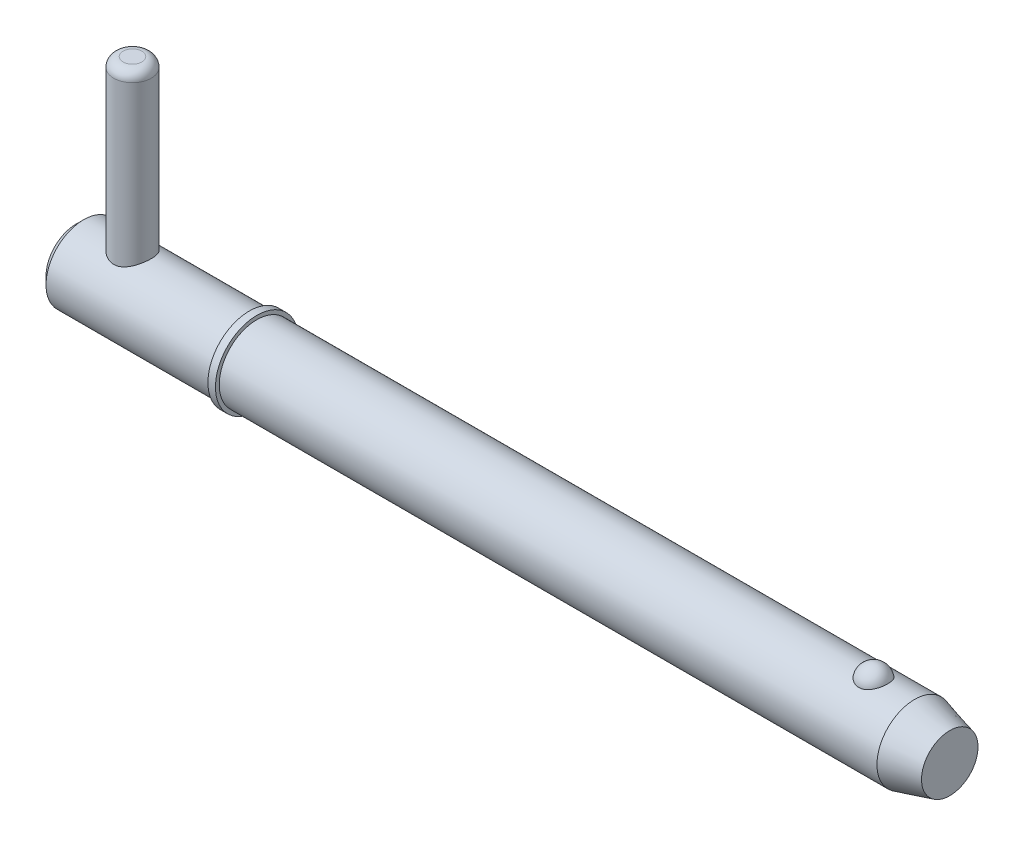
ISO-10303-21;
HEADER;
FILE_DESCRIPTION(('STEP AP214'),'2;1');
FILE_NAME('part.step','',(''),(''),'','','');
FILE_SCHEMA(('AUTOMOTIVE_DESIGN { 1 0 10303 214 1 1 1 1 }'));
ENDSEC;
DATA;
#1=APPLICATION_CONTEXT('core data for automotive mechanical design processes');
#2=APPLICATION_PROTOCOL_DEFINITION('international standard','automotive_design',2000,#1);
#3=PRODUCT_CONTEXT('',#1,'mechanical');
#4=PRODUCT('Part','Part','',(#3));
#5=PRODUCT_RELATED_PRODUCT_CATEGORY('part','',(#4));
#6=PRODUCT_DEFINITION_FORMATION('','',#4);
#7=PRODUCT_DEFINITION_CONTEXT('part definition',#1,'design');
#8=PRODUCT_DEFINITION('design','',#6,#7);
#9=PRODUCT_DEFINITION_SHAPE('','',#8);
#10=(LENGTH_UNIT() NAMED_UNIT(*) SI_UNIT(.MILLI.,.METRE.));
#11=(NAMED_UNIT(*) PLANE_ANGLE_UNIT() SI_UNIT($,.RADIAN.));
#12=(NAMED_UNIT(*) SI_UNIT($,.STERADIAN.) SOLID_ANGLE_UNIT());
#13=UNCERTAINTY_MEASURE_WITH_UNIT(LENGTH_MEASURE(1.E-05),#10,'distance_accuracy_value','');
#14=(GEOMETRIC_REPRESENTATION_CONTEXT(3) GLOBAL_UNCERTAINTY_ASSIGNED_CONTEXT((#13)) GLOBAL_UNIT_ASSIGNED_CONTEXT((#10,
#11,#12)) REPRESENTATION_CONTEXT('',''));
#15=CARTESIAN_POINT('',(0.,0.,0.));
#16=DIRECTION('',(0.,0.,1.));
#17=DIRECTION('',(1.,0.,0.));
#18=AXIS2_PLACEMENT_3D('',#15,#16,#17);
#19=CARTESIAN_POINT('',(5.94,21.43,0.));
#20=DIRECTION('',(0.,-1.,0.));
#21=DIRECTION('',(0.,0.,-1.));
#22=AXIS2_PLACEMENT_3D('',#19,#20,#21);
#23=CYLINDRICAL_SURFACE('',#22,1.98);
#24=CARTESIAN_POINT('',(5.94,-2.98,0.));
#25=DIRECTION('',(0.,1.,0.));
#26=DIRECTION('',(0.,0.,1.));
#27=AXIS2_PLACEMENT_3D('',#24,#25,#26);
#28=CIRCLE('',#27,1.98);
#29=CARTESIAN_POINT('',(5.94,-2.98,1.98));
#30=VERTEX_POINT('',#29);
#31=EDGE_CURVE('P0_E25',#30,#30,#28,.T.);
#32=ORIENTED_EDGE('',*,*,#31,.T.);
#33=EDGE_LOOP('',(#32));
#34=FACE_BOUND('',#33,.T.);
#35=CARTESIAN_POINT('',(5.94,20.44,0.));
#36=DIRECTION('',(0.,1.,0.));
#37=DIRECTION('',(0.,0.,1.));
#38=AXIS2_PLACEMENT_3D('',#35,#36,#37);
#39=CIRCLE('',#38,1.98);
#40=CARTESIAN_POINT('',(5.94,20.44,1.98));
#41=VERTEX_POINT('',#40);
#42=EDGE_CURVE('P0_E29',#41,#41,#39,.F.);
#43=ORIENTED_EDGE('',*,*,#42,.T.);
#44=EDGE_LOOP('',(#43));
#45=FACE_BOUND('',#44,.T.);
#46=ADVANCED_FACE('P0_F14',(#34,#45),#23,.T.);
#47=CARTESIAN_POINT('',(5.94,21.43,0.));
#48=DIRECTION('',(0.,1.,0.));
#49=DIRECTION('',(0.,0.,1.));
#50=AXIS2_PLACEMENT_3D('',#47,#48,#49);
#51=PLANE('',#50);
#52=CARTESIAN_POINT('',(5.94,21.43,0.));
#53=DIRECTION('',(0.,1.,0.));
#54=DIRECTION('',(0.,0.,1.));
#55=AXIS2_PLACEMENT_3D('',#52,#53,#54);
#56=CIRCLE('',#55,0.99);
#57=CARTESIAN_POINT('',(5.94,21.43,0.99));
#58=VERTEX_POINT('',#57);
#59=EDGE_CURVE('P0_E10',#58,#58,#56,.T.);
#60=ORIENTED_EDGE('',*,*,#59,.T.);
#61=EDGE_LOOP('',(#60));
#62=FACE_BOUND('',#61,.T.);
#63=ADVANCED_FACE('P0_F46',(#62),#51,.T.);
#64=CARTESIAN_POINT('',(5.94,-3.97,0.));
#65=DIRECTION('',(0.,1.,0.));
#66=DIRECTION('',(0.,0.,1.));
#67=AXIS2_PLACEMENT_3D('',#64,#65,#66);
#68=PLANE('',#67);
#69=CARTESIAN_POINT('',(5.94,-3.97,0.));
#70=DIRECTION('',(0.,1.,0.));
#71=DIRECTION('',(0.,0.,1.));
#72=AXIS2_PLACEMENT_3D('',#69,#70,#71);
#73=CIRCLE('',#72,0.99);
#74=CARTESIAN_POINT('',(5.94,-3.97,0.99));
#75=VERTEX_POINT('',#74);
#76=EDGE_CURVE('P0_E21',#75,#75,#73,.F.);
#77=ORIENTED_EDGE('',*,*,#76,.T.);
#78=EDGE_LOOP('',(#77));
#79=FACE_BOUND('',#78,.T.);
#80=ADVANCED_FACE('P0_F43',(#79),#68,.F.);
#81=CARTESIAN_POINT('',(5.94,-2.98,0.));
#82=DIRECTION('',(0.,1.,0.));
#83=DIRECTION('',(0.,0.,1.));
#84=AXIS2_PLACEMENT_3D('',#81,#82,#83);
#85=DEGENERATE_TOROIDAL_SURFACE('',#84,0.99,0.99,.T.);
#86=ORIENTED_EDGE('',*,*,#76,.F.);
#87=EDGE_LOOP('',(#86));
#88=FACE_BOUND('',#87,.T.);
#89=ORIENTED_EDGE('',*,*,#31,.F.);
#90=EDGE_LOOP('',(#89));
#91=FACE_BOUND('',#90,.T.);
#92=ADVANCED_FACE('P0_F38',(#88,#91),#85,.T.);
#93=CARTESIAN_POINT('',(5.94,20.44,0.));
#94=DIRECTION('',(0.,1.,0.));
#95=DIRECTION('',(0.,0.,1.));
#96=AXIS2_PLACEMENT_3D('',#93,#94,#95);
#97=DEGENERATE_TOROIDAL_SURFACE('',#96,0.99,0.99,.T.);
#98=ORIENTED_EDGE('',*,*,#42,.F.);
#99=EDGE_LOOP('',(#98));
#100=FACE_BOUND('',#99,.T.);
#101=ORIENTED_EDGE('',*,*,#59,.F.);
#102=EDGE_LOOP('',(#101));
#103=FACE_BOUND('',#102,.T.);
#104=ADVANCED_FACE('P0_F16',(#100,#103),#97,.T.);
#105=CLOSED_SHELL('',(#46,#63,#80,#92,#104));
#106=MANIFOLD_SOLID_BREP('P0_B1',#105);
#107=CARTESIAN_POINT('',(0.,0.,0.));
#108=DIRECTION('',(1.,0.,0.));
#109=DIRECTION('',(0.,0.,-1.));
#110=AXIS2_PLACEMENT_3D('',#107,#108,#109);
#111=CYLINDRICAL_SURFACE('',#110,3.97);
#112=CARTESIAN_POINT('',(88.3759395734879,0.,0.));
#113=DIRECTION('',(1.,0.,0.));
#114=DIRECTION('',(0.,0.,-1.));
#115=AXIS2_PLACEMENT_3D('',#112,#113,#114);
#116=CIRCLE('',#115,3.97);
#117=CARTESIAN_POINT('',(88.3759395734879,0.,-3.97));
#118=VERTEX_POINT('',#117);
#119=EDGE_CURVE('P1_E81',#118,#118,#116,.T.);
#120=ORIENTED_EDGE('',*,*,#119,.F.);
#121=EDGE_LOOP('',(#120));
#122=FACE_BOUND('',#121,.T.);
#123=CARTESIAN_POINT('',(19.05,0.,0.));
#124=DIRECTION('',(1.,0.,0.));
#125=DIRECTION('',(0.,0.,-1.));
#126=AXIS2_PLACEMENT_3D('',#123,#124,#125);
#127=CIRCLE('',#126,3.97);
#128=CARTESIAN_POINT('',(19.05,0.,-3.97));
#129=VERTEX_POINT('',#128);
#130=EDGE_CURVE('P1_E85',#129,#129,#127,.T.);
#131=ORIENTED_EDGE('',*,*,#130,.T.);
#132=EDGE_LOOP('',(#131));
#133=FACE_BOUND('',#132,.T.);
#134=CARTESIAN_POINT('',(84.0451922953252,3.65715365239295,1.54470941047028));
#135=CARTESIAN_POINT('',(83.9652448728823,3.65716001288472,1.54470290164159));
#136=CARTESIAN_POINT('',(83.8851650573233,3.65987074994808,1.53832549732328));
#137=CARTESIAN_POINT('',(83.7272374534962,3.6704221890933,1.51297018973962));
#138=CARTESIAN_POINT('',(83.6493961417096,3.67827646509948,1.49395894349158));
#139=CARTESIAN_POINT('',(83.4984614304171,3.69818848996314,1.44395950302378));
#140=CARTESIAN_POINT('',(83.4253560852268,3.71023513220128,1.41300293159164));
#141=CARTESIAN_POINT('',(83.2855630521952,3.73721833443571,1.34000212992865));
#142=CARTESIAN_POINT('',(83.2188725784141,3.75215363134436,1.2979627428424));
#143=CARTESIAN_POINT('',(83.0914886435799,3.78384968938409,1.20248834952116));
#144=CARTESIAN_POINT('',(83.0310299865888,3.80065129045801,1.14875388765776));
#145=CARTESIAN_POINT('',(82.9196942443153,3.83398532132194,1.03205417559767));
#146=CARTESIAN_POINT('',(82.8688200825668,3.85051766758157,0.969086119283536));
#147=CARTESIAN_POINT('',(82.7756321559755,3.88238608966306,0.832526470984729));
#148=CARTESIAN_POINT('',(82.7337961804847,3.89763698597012,0.758588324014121));
#149=CARTESIAN_POINT('',(82.6625108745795,3.92451063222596,0.60435211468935));
#150=CARTESIAN_POINT('',(82.6330623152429,3.93613315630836,0.524053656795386));
#151=CARTESIAN_POINT('',(82.5868927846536,3.95467606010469,0.358403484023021));
#152=CARTESIAN_POINT('',(82.5703127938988,3.96154426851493,0.273006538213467));
#153=CARTESIAN_POINT('',(82.550756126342,3.96967008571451,0.100408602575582));
#154=CARTESIAN_POINT('',(82.5477789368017,3.97092790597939,0.0132076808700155));
#155=CARTESIAN_POINT('',(82.5554587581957,3.96771794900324,-0.159844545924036));
#156=CARTESIAN_POINT('',(82.5660164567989,3.96329187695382,-0.245701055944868));
#157=CARTESIAN_POINT('',(82.6003800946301,3.94923163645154,-0.41427746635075));
#158=CARTESIAN_POINT('',(82.6241862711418,3.93959737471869,-0.496997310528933));
#159=CARTESIAN_POINT('',(82.6846114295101,3.91607752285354,-0.657113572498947));
#160=CARTESIAN_POINT('',(82.7212495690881,3.90218558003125,-0.734501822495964));
#161=CARTESIAN_POINT('',(82.8065935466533,3.87158287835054,-0.881704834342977));
#162=CARTESIAN_POINT('',(82.8553004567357,3.8548718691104,-0.951518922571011));
#163=CARTESIAN_POINT('',(82.9641161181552,3.82028735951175,-1.08208159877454));
#164=CARTESIAN_POINT('',(83.0242955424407,3.80240713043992,-1.14276958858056));
#165=CARTESIAN_POINT('',(83.154493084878,3.76758161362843,-1.2528243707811));
#166=CARTESIAN_POINT('',(83.2245105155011,3.75063626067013,-1.30219195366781));
#167=CARTESIAN_POINT('',(83.37118160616,3.71998948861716,-1.38729709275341));
#168=CARTESIAN_POINT('',(83.4476813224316,3.70623183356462,-1.42327904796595));
#169=CARTESIAN_POINT('',(83.6062981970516,3.68323188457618,-1.48178996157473));
#170=CARTESIAN_POINT('',(83.6884132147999,3.67398788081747,-1.5043240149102));
#171=CARTESIAN_POINT('',(83.8514810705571,3.6615216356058,-1.53440939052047));
#172=CARTESIAN_POINT('',(83.9322840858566,3.65801951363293,-1.54265826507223));
#173=CARTESIAN_POINT('',(84.0942085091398,3.65657341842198,-1.54608423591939));
#174=CARTESIAN_POINT('',(84.1753298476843,3.65862829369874,-1.54126404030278));
#175=CARTESIAN_POINT('',(84.3328122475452,3.66788969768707,-1.51908474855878));
#176=CARTESIAN_POINT('',(84.4092422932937,3.67492621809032,-1.50213925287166));
#177=CARTESIAN_POINT('',(84.5580412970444,3.69318404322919,-1.45666982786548));
#178=CARTESIAN_POINT('',(84.6304099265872,3.70440568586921,-1.42814496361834));
#179=CARTESIAN_POINT('',(84.7708029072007,3.73012749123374,-1.35956319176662));
#180=CARTESIAN_POINT('',(84.8387000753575,3.74469307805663,-1.31927107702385));
#181=CARTESIAN_POINT('',(84.9668649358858,3.77545272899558,-1.22847440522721));
#182=CARTESIAN_POINT('',(85.0271308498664,3.79164717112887,-1.17796747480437));
#183=CARTESIAN_POINT('',(85.1416346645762,3.82490325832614,-1.06519260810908));
#184=CARTESIAN_POINT('',(85.1954137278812,3.84196735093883,-1.00245914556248));
#185=CARTESIAN_POINT('',(85.2920988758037,3.87439863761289,-0.868715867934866));
#186=CARTESIAN_POINT('',(85.3350030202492,3.88976552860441,-0.797704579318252));
#187=CARTESIAN_POINT('',(85.410266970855,3.91771381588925,-0.646896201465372));
#188=CARTESIAN_POINT('',(85.4422532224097,3.93019255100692,-0.566893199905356));
#189=CARTESIAN_POINT('',(85.4931101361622,3.95043886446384,-0.402255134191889));
#190=CARTESIAN_POINT('',(85.5119807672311,3.95820643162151,-0.317620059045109));
#191=CARTESIAN_POINT('',(85.5362162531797,3.96823733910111,-0.146156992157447));
#192=CARTESIAN_POINT('',(85.5415874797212,3.970503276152,-0.0593300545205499));
#193=CARTESIAN_POINT('',(85.5387309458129,3.96930811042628,0.114057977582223));
#194=CARTESIAN_POINT('',(85.530503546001,3.9658471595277,0.200619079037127));
#195=CARTESIAN_POINT('',(85.5007063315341,3.95358562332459,0.370506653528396));
#196=CARTESIAN_POINT('',(85.4792129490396,3.94481563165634,0.453848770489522));
#197=CARTESIAN_POINT('',(85.4233839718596,3.92284586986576,0.615497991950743));
#198=CARTESIAN_POINT('',(85.3890474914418,3.90964579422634,0.693804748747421));
#199=CARTESIAN_POINT('',(85.3079702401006,3.88006987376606,0.843703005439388));
#200=CARTESIAN_POINT('',(85.2611536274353,3.86367478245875,0.915249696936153));
#201=CARTESIAN_POINT('',(85.1561897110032,3.82949741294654,1.04910810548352));
#202=CARTESIAN_POINT('',(85.0980428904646,3.81171519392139,1.11142021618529));
#203=CARTESIAN_POINT('',(84.9717433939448,3.77673366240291,1.22503948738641));
#204=CARTESIAN_POINT('',(84.9035970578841,3.75953398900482,1.27635357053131));
#205=CARTESIAN_POINT('',(84.7589009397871,3.72770506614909,1.36653336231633));
#206=CARTESIAN_POINT('',(84.682348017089,3.71307678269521,1.40539439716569));
#207=CARTESIAN_POINT('',(84.5257594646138,3.68864287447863,1.46830480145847));
#208=CARTESIAN_POINT('',(84.4459307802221,3.67869017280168,1.49281289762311));
#209=CARTESIAN_POINT('',(84.2829877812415,3.66414535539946,1.52817474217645));
#210=CARTESIAN_POINT('',(84.1998840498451,3.65953723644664,1.53906926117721));
#211=CARTESIAN_POINT('',(84.0927760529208,3.6573894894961,1.54414878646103));
#212=CARTESIAN_POINT('',(84.0689900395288,3.65715175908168,1.54471134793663));
#213=CARTESIAN_POINT('',(84.0451922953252,3.65715365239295,1.54470941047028));
#214=B_SPLINE_CURVE_WITH_KNOTS('',3,(#134,#135,#136,#137,#138,#139,#140,#141,#142,#143,#144,
#145,#146,#147,#148,#149,#150,#151,#152,#153,#154,#155,#156,#157,#158,#159,#160,#161,#162,#163,
#164,#165,#166,#167,#168,#169,#170,#171,#172,#173,#174,#175,#176,#177,#178,#179,#180,#181,#182,
#183,#184,#185,#186,#187,#188,#189,#190,#191,#192,#193,#194,#195,#196,#197,#198,#199,#200,#201,
#202,#203,#204,#205,#206,#207,#208,#209,#210,#211,#212,#213),.UNSPECIFIED.,.T.,.F.,(4,2,2,2,2,2,
2,2,2,2,2,2,2,2,2,2,2,2,2,2,2,2,2,2,2,2,2,2,2,2,2,2,2,2,2,2,2,2,2,4),(0.,0.239777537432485,
0.480190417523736,0.719971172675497,0.959647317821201,1.20639040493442,1.45320863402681,
1.7109367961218,1.96868099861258,2.22921052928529,2.48973023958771,2.74834928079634,
3.00697295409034,3.26598440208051,3.52501886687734,3.78570385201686,4.04637062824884,
4.30201257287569,4.5575576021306,4.80022994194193,5.04285200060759,5.27757006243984,
5.51230707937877,5.75210128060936,5.99195126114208,6.24392810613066,6.49594987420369,
6.75588818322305,7.01582710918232,7.27564332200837,7.53545264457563,7.79377886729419,
8.0521229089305,8.31207418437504,8.57201437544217,8.83179046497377,9.09166393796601,
9.34270057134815,9.59298357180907,9.66435753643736),.UNSPECIFIED.);
#215=CARTESIAN_POINT('',(84.0451922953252,3.65715365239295,1.54470941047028));
#216=VERTEX_POINT('',#215);
#217=EDGE_CURVE('P1_E35',#216,#216,#214,.T.);
#218=ORIENTED_EDGE('',*,*,#217,.T.);
#219=EDGE_LOOP('',(#218));
#220=FACE_BOUND('',#219,.T.);
#221=ADVANCED_FACE('P1_F13',(#122,#133,#220),#111,.T.);
#222=CARTESIAN_POINT('',(0.,0.,0.));
#223=DIRECTION('',(-1.,0.,0.));
#224=DIRECTION('',(0.,0.,1.));
#225=AXIS2_PLACEMENT_3D('',#222,#223,#224);
#226=PLANE('',#225);
#227=CARTESIAN_POINT('',(0.,0.,0.));
#228=DIRECTION('',(1.,0.,0.));
#229=DIRECTION('',(0.,0.,-1.));
#230=AXIS2_PLACEMENT_3D('',#227,#228,#229);
#231=CIRCLE('',#230,3.176);
#232=CARTESIAN_POINT('',(0.,0.,-3.176));
#233=VERTEX_POINT('',#232);
#234=EDGE_CURVE('P1_E9',#233,#233,#231,.T.);
#235=ORIENTED_EDGE('',*,*,#234,.F.);
#236=EDGE_LOOP('',(#235));
#237=FACE_BOUND('',#236,.T.);
#238=ADVANCED_FACE('P1_F15',(#237),#226,.T.);
#239=CARTESIAN_POINT('',(0.793999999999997,0.,0.));
#240=DIRECTION('',(1.,0.,0.));
#241=DIRECTION('',(0.,0.,-1.));
#242=AXIS2_PLACEMENT_3D('',#239,#240,#241);
#243=CONICAL_SURFACE('',#242,3.97,0.78539816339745);
#244=ORIENTED_EDGE('',*,*,#234,.T.);
#245=EDGE_LOOP('',(#244));
#246=FACE_BOUND('',#245,.T.);
#247=CARTESIAN_POINT('',(0.793999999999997,0.,0.));
#248=DIRECTION('',(1.,0.,0.));
#249=DIRECTION('',(0.,0.,-1.));
#250=AXIS2_PLACEMENT_3D('',#247,#248,#249);
#251=CIRCLE('',#250,3.97);
#252=CARTESIAN_POINT('',(0.793999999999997,0.,-3.97));
#253=VERTEX_POINT('',#252);
#254=EDGE_CURVE('P1_E26',#253,#253,#251,.T.);
#255=ORIENTED_EDGE('',*,*,#254,.F.);
#256=EDGE_LOOP('',(#255));
#257=FACE_BOUND('',#256,.T.);
#258=ADVANCED_FACE('P1_F77',(#246,#257),#243,.T.);
#259=CARTESIAN_POINT('',(0.,0.,0.));
#260=DIRECTION('',(1.,0.,0.));
#261=DIRECTION('',(0.,0.,-1.));
#262=AXIS2_PLACEMENT_3D('',#259,#260,#261);
#263=CYLINDRICAL_SURFACE('',#262,3.97);
#264=CARTESIAN_POINT('',(5.94,-3.44100276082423,1.98));
#265=CARTESIAN_POINT('',(5.8367885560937,-3.44101282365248,1.97999171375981));
#266=CARTESIAN_POINT('',(5.73344176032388,-3.44571749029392,1.97187534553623));
#267=CARTESIAN_POINT('',(5.52991905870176,-3.46385873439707,1.93981946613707));
#268=CARTESIAN_POINT('',(5.42975031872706,-3.47731375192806,1.91584653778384));
#269=CARTESIAN_POINT('',(5.23590869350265,-3.51100678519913,1.85336773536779));
#270=CARTESIAN_POINT('',(5.14220446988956,-3.53120882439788,1.81493880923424));
#271=CARTESIAN_POINT('',(4.9625969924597,-3.57606420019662,1.72487335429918));
#272=CARTESIAN_POINT('',(4.87669412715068,-3.6007177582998,1.67323616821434));
#273=CARTESIAN_POINT('',(4.70734412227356,-3.65417020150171,1.55325205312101));
#274=CARTESIAN_POINT('',(4.62467662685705,-3.68314323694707,1.4838818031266));
#275=CARTESIAN_POINT('',(4.47154355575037,-3.74056406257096,1.33252902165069));
#276=CARTESIAN_POINT('',(4.40108404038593,-3.76901158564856,1.25054026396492));
#277=CARTESIAN_POINT('',(4.26974803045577,-3.82445556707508,1.06956584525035));
#278=CARTESIAN_POINT('',(4.20982960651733,-3.8512271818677,0.969809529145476));
#279=CARTESIAN_POINT('',(4.10798077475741,-3.89804342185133,0.760047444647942));
#280=CARTESIAN_POINT('',(4.06603907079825,-3.91809226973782,0.650048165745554));
#281=CARTESIAN_POINT('',(4.00441878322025,-3.94794912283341,0.431181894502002));
#282=CARTESIAN_POINT('',(3.98337329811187,-3.95838209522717,0.322786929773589));
#283=CARTESIAN_POINT('',(3.9596425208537,-3.97016407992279,0.103541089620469));
#284=CARTESIAN_POINT('',(3.95694618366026,-3.97151855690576,-0.00730826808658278));
#285=CARTESIAN_POINT('',(3.9694599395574,-3.96528826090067,-0.218044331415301));
#286=CARTESIAN_POINT('',(3.98314071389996,-3.95846689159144,-0.318049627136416));
#287=CARTESIAN_POINT('',(4.02528522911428,-3.93780347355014,-0.514124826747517));
#288=CARTESIAN_POINT('',(4.05375007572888,-3.92396089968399,-0.61019443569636));
#289=CARTESIAN_POINT('',(4.12484256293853,-3.89028355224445,-0.797351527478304));
#290=CARTESIAN_POINT('',(4.16766142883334,-3.87036821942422,-0.888351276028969));
#291=CARTESIAN_POINT('',(4.26598377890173,-3.82634285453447,-1.06209448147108));
#292=CARTESIAN_POINT('',(4.32149181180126,-3.8022313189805,-1.14483496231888));
#293=CARTESIAN_POINT('',(4.44962332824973,-3.74940011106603,-1.30802500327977));
#294=CARTESIAN_POINT('',(4.52336636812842,-3.72046031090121,-1.38752498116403));
#295=CARTESIAN_POINT('',(4.68287656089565,-3.66269463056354,-1.53354043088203));
#296=CARTESIAN_POINT('',(4.7686527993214,-3.63386885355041,-1.60004599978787));
#297=CARTESIAN_POINT('',(4.9564069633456,-3.57763161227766,-1.72228426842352));
#298=CARTESIAN_POINT('',(5.05906485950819,-3.5504233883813,-1.77707534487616));
#299=CARTESIAN_POINT('',(5.27381412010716,-3.50334038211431,-1.86819784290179));
#300=CARTESIAN_POINT('',(5.38589553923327,-3.48345798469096,-1.90454844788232));
#301=CARTESIAN_POINT('',(5.6069795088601,-3.45548331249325,-1.95481643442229));
#302=CARTESIAN_POINT('',(5.71552407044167,-3.44658268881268,-1.97028113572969));
#303=CARTESIAN_POINT('',(5.93399639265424,-3.43928114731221,-1.98300600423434));
#304=CARTESIAN_POINT('',(6.04392313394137,-3.44087289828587,-1.98027888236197));
#305=CARTESIAN_POINT('',(6.24931618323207,-3.45351901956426,-1.95811780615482));
#306=CARTESIAN_POINT('',(6.34505668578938,-3.46352725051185,-1.94052989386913));
#307=CARTESIAN_POINT('',(6.53204702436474,-3.49033612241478,-1.89188242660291));
#308=CARTESIAN_POINT('',(6.62329540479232,-3.50713894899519,-1.86081853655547));
#309=CARTESIAN_POINT('',(6.80352105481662,-3.54655680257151,-1.78458666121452));
#310=CARTESIAN_POINT('',(6.89219712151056,-3.56940508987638,-1.73883178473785));
#311=CARTESIAN_POINT('',(7.06112449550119,-3.61813012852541,-1.63502913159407));
#312=CARTESIAN_POINT('',(7.14137144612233,-3.6440084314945,-1.57697504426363));
#313=CARTESIAN_POINT('',(7.30168083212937,-3.69977514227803,-1.44171920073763));
#314=CARTESIAN_POINT('',(7.38046039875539,-3.7297597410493,-1.36302972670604));
#315=CARTESIAN_POINT('',(7.52409649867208,-3.78754991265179,-1.19307190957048));
#316=CARTESIAN_POINT('',(7.58894840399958,-3.81535475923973,-1.10179940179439));
#317=CARTESIAN_POINT('',(7.70430122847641,-3.86658972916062,-0.906019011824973));
#318=CARTESIAN_POINT('',(7.75438714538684,-3.88988795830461,-0.801229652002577));
#319=CARTESIAN_POINT('',(7.83572184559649,-3.92848199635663,-0.583216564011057));
#320=CARTESIAN_POINT('',(7.86698708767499,-3.94378479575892,-0.470000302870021));
#321=CARTESIAN_POINT('',(7.90711051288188,-3.96355307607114,-0.249525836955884));
#322=CARTESIAN_POINT('',(7.91775648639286,-3.96888171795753,-0.142669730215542));
#323=CARTESIAN_POINT('',(7.92160247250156,-3.97079858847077,0.0714191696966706));
#324=CARTESIAN_POINT('',(7.91480852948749,-3.96738984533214,0.178651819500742));
#325=CARTESIAN_POINT('',(7.88515479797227,-3.9527181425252,0.383072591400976));
#326=CARTESIAN_POINT('',(7.8633739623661,-3.94198303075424,0.480459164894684));
#327=CARTESIAN_POINT('',(7.80581513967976,-3.91422178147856,0.670038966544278));
#328=CARTESIAN_POINT('',(7.77003513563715,-3.89719473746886,0.762231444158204));
#329=CARTESIAN_POINT('',(7.68389191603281,-3.85747818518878,0.943248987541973));
#330=CARTESIAN_POINT('',(7.63296879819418,-3.83457704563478,1.03175978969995));
#331=CARTESIAN_POINT('',(7.51869140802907,-3.7855122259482,1.19934744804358));
#332=CARTESIAN_POINT('',(7.45533142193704,-3.75934704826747,1.2784199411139));
#333=CARTESIAN_POINT('',(7.31068939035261,-3.70329841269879,1.433144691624));
#334=CARTESIAN_POINT('',(7.22825362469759,-3.67330340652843,1.50768183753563));
#335=CARTESIAN_POINT('',(7.05162367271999,-3.61514025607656,1.64226879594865));
#336=CARTESIAN_POINT('',(6.95741928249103,-3.58697372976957,1.70230590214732));
#337=CARTESIAN_POINT('',(6.75590859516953,-3.53504049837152,1.80775364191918));
#338=CARTESIAN_POINT('',(6.64828786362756,-3.51143624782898,1.85265616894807));
#339=CARTESIAN_POINT('',(6.48137774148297,-3.48289659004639,1.90544537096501));
#340=CARTESIAN_POINT('',(6.42488151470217,-3.4745323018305,1.9206071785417));
#341=CARTESIAN_POINT('',(6.31046920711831,-3.4604244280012,1.94591259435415));
#342=CARTESIAN_POINT('',(6.25255415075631,-3.45467900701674,1.95605971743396));
#343=CARTESIAN_POINT('',(6.1521444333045,-3.44728060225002,1.96905939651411));
#344=CARTESIAN_POINT('',(6.10985721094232,-3.44493297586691,1.97315742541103));
#345=CARTESIAN_POINT('',(6.02505433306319,-3.44179192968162,1.97862952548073));
#346=CARTESIAN_POINT('',(5.98253866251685,-3.44099861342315,1.98000341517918));
#347=CARTESIAN_POINT('',(5.94,-3.44100276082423,1.98));
#348=B_SPLINE_CURVE_WITH_KNOTS('',3,(#264,#265,#266,#267,#268,#269,#270,#271,#272,#273,#274,
#275,#276,#277,#278,#279,#280,#281,#282,#283,#284,#285,#286,#287,#288,#289,#290,#291,#292,#293,
#294,#295,#296,#297,#298,#299,#300,#301,#302,#303,#304,#305,#306,#307,#308,#309,#310,#311,#312,
#313,#314,#315,#316,#317,#318,#319,#320,#321,#322,#323,#324,#325,#326,#327,#328,#329,#330,#331,
#332,#333,#334,#335,#336,#337,#338,#339,#340,#341,#342,#343,#344,#345,#346,#347),.UNSPECIFIED.,
.T.,.F.,(4,2,2,2,2,2,2,2,2,2,2,2,2,2,2,2,2,2,2,2,2,2,2,2,2,2,2,2,2,2,2,2,2,2,2,2,2,2,2,2,2,4),
(0.,0.309462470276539,0.619579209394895,0.928068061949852,1.23657226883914,1.57038619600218,
1.90436536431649,2.26071614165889,2.61684266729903,2.94773555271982,3.27842924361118,
3.58050679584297,3.88260694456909,4.18890317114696,4.49530936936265,4.83057163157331,
5.1660884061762,5.52272472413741,5.87898927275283,6.20706708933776,6.53491569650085,
6.82716910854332,7.11951660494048,7.42541184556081,7.73146442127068,8.07586334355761,
8.42037652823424,8.77380887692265,9.12693169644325,9.44775848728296,9.76847409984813,
10.0682302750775,10.3680296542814,10.6806938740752,10.9935020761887,11.3373031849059,
11.6814044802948,12.0361164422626,12.2131519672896,12.3900632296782,12.5175998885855,
12.6451450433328),.UNSPECIFIED.);
#349=CARTESIAN_POINT('',(5.94,-3.44100276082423,1.98));
#350=VERTEX_POINT('',#349);
#351=EDGE_CURVE('P1_E17',#350,#350,#348,.T.);
#352=ORIENTED_EDGE('',*,*,#351,.F.);
#353=EDGE_LOOP('',(#352));
#354=FACE_BOUND('',#353,.T.);
#355=CARTESIAN_POINT('',(5.94,3.44100276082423,1.98));
#356=CARTESIAN_POINT('',(6.0432114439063,3.44101282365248,1.97999171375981));
#357=CARTESIAN_POINT('',(6.14655823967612,3.44571749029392,1.97187534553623));
#358=CARTESIAN_POINT('',(6.35008094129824,3.46385873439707,1.93981946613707));
#359=CARTESIAN_POINT('',(6.45024968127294,3.47731375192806,1.91584653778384));
#360=CARTESIAN_POINT('',(6.64409130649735,3.51100678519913,1.85336773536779));
#361=CARTESIAN_POINT('',(6.73779553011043,3.53120882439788,1.81493880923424));
#362=CARTESIAN_POINT('',(6.91740300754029,3.57606420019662,1.72487335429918));
#363=CARTESIAN_POINT('',(7.00330587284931,3.6007177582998,1.67323616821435));
#364=CARTESIAN_POINT('',(7.17265587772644,3.65417020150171,1.55325205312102));
#365=CARTESIAN_POINT('',(7.25532337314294,3.68314323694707,1.4838818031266));
#366=CARTESIAN_POINT('',(7.40845644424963,3.74056406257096,1.3325290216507));
#367=CARTESIAN_POINT('',(7.47891595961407,3.76901158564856,1.25054026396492));
#368=CARTESIAN_POINT('',(7.61025196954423,3.82445556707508,1.06956584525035));
#369=CARTESIAN_POINT('',(7.67017039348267,3.8512271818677,0.969809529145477));
#370=CARTESIAN_POINT('',(7.77201922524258,3.89804342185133,0.760047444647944));
#371=CARTESIAN_POINT('',(7.81396092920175,3.91809226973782,0.650048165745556));
#372=CARTESIAN_POINT('',(7.87558121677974,3.94794912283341,0.431181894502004));
#373=CARTESIAN_POINT('',(7.89662670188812,3.95838209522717,0.322786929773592));
#374=CARTESIAN_POINT('',(7.9203574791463,3.97016407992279,0.103541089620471));
#375=CARTESIAN_POINT('',(7.92305381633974,3.97151855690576,-0.00730826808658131));
#376=CARTESIAN_POINT('',(7.9105400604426,3.96528826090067,-0.2180443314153));
#377=CARTESIAN_POINT('',(7.89685928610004,3.95846689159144,-0.318049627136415));
#378=CARTESIAN_POINT('',(7.85471477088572,3.93780347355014,-0.514124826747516));
#379=CARTESIAN_POINT('',(7.82624992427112,3.92396089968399,-0.61019443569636));
#380=CARTESIAN_POINT('',(7.75515743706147,3.89028355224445,-0.797351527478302));
#381=CARTESIAN_POINT('',(7.71233857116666,3.87036821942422,-0.888351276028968));
#382=CARTESIAN_POINT('',(7.61401622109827,3.82634285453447,-1.06209448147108));
#383=CARTESIAN_POINT('',(7.55850818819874,3.8022313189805,-1.14483496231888));
#384=CARTESIAN_POINT('',(7.43037667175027,3.74940011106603,-1.30802500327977));
#385=CARTESIAN_POINT('',(7.35663363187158,3.72046031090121,-1.38752498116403));
#386=CARTESIAN_POINT('',(7.19712343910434,3.66269463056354,-1.53354043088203));
#387=CARTESIAN_POINT('',(7.1113472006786,3.63386885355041,-1.60004599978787));
#388=CARTESIAN_POINT('',(6.9235930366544,3.57763161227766,-1.72228426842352));
#389=CARTESIAN_POINT('',(6.82093514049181,3.5504233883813,-1.77707534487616));
#390=CARTESIAN_POINT('',(6.60618587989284,3.50334038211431,-1.86819784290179));
#391=CARTESIAN_POINT('',(6.49410446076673,3.48345798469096,-1.90454844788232));
#392=CARTESIAN_POINT('',(6.2730204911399,3.45548331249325,-1.95481643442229));
#393=CARTESIAN_POINT('',(6.16447592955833,3.44658268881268,-1.97028113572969));
#394=CARTESIAN_POINT('',(5.94600360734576,3.43928114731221,-1.98300600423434));
#395=CARTESIAN_POINT('',(5.83607686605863,3.44087289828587,-1.98027888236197));
#396=CARTESIAN_POINT('',(5.63068381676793,3.45351901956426,-1.95811780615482));
#397=CARTESIAN_POINT('',(5.53494331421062,3.46352725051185,-1.94052989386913));
#398=CARTESIAN_POINT('',(5.34795297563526,3.49033612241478,-1.89188242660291));
#399=CARTESIAN_POINT('',(5.25670459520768,3.50713894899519,-1.86081853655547));
#400=CARTESIAN_POINT('',(5.07647894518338,3.54655680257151,-1.78458666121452));
#401=CARTESIAN_POINT('',(4.98780287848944,3.56940508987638,-1.73883178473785));
#402=CARTESIAN_POINT('',(4.81887550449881,3.61813012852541,-1.63502913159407));
#403=CARTESIAN_POINT('',(4.73862855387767,3.6440084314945,-1.57697504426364));
#404=CARTESIAN_POINT('',(4.57831916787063,3.69977514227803,-1.44171920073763));
#405=CARTESIAN_POINT('',(4.49953960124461,3.7297597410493,-1.36302972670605));
#406=CARTESIAN_POINT('',(4.35590350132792,3.78754991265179,-1.19307190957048));
#407=CARTESIAN_POINT('',(4.29105159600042,3.81535475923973,-1.10179940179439));
#408=CARTESIAN_POINT('',(4.17569877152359,3.86658972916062,-0.906019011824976));
#409=CARTESIAN_POINT('',(4.12561285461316,3.88988795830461,-0.80122965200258));
#410=CARTESIAN_POINT('',(4.04427815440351,3.92848199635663,-0.58321656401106));
#411=CARTESIAN_POINT('',(4.01301291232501,3.94378479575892,-0.470000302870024));
#412=CARTESIAN_POINT('',(3.97288948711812,3.96355307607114,-0.249525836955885));
#413=CARTESIAN_POINT('',(3.96224351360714,3.96888171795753,-0.142669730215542));
#414=CARTESIAN_POINT('',(3.95839752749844,3.97079858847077,0.0714191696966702));
#415=CARTESIAN_POINT('',(3.96519147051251,3.96738984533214,0.178651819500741));
#416=CARTESIAN_POINT('',(3.99484520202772,3.9527181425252,0.383072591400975));
#417=CARTESIAN_POINT('',(4.01662603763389,3.94198303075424,0.480459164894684));
#418=CARTESIAN_POINT('',(4.07418486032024,3.91422178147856,0.670038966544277));
#419=CARTESIAN_POINT('',(4.10996486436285,3.89719473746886,0.762231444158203));
#420=CARTESIAN_POINT('',(4.19610808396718,3.85747818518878,0.943248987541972));
#421=CARTESIAN_POINT('',(4.24703120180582,3.83457704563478,1.03175978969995));
#422=CARTESIAN_POINT('',(4.36130859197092,3.7855122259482,1.19934744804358));
#423=CARTESIAN_POINT('',(4.42466857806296,3.75934704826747,1.2784199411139));
#424=CARTESIAN_POINT('',(4.56931060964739,3.70329841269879,1.433144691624));
#425=CARTESIAN_POINT('',(4.65174637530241,3.67330340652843,1.50768183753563));
#426=CARTESIAN_POINT('',(4.82837632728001,3.61514025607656,1.64226879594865));
#427=CARTESIAN_POINT('',(4.92258071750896,3.58697372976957,1.70230590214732));
#428=CARTESIAN_POINT('',(5.12409140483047,3.53504049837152,1.80775364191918));
#429=CARTESIAN_POINT('',(5.23171213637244,3.51143624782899,1.85265616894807));
#430=CARTESIAN_POINT('',(5.39862225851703,3.48289659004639,1.90544537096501));
#431=CARTESIAN_POINT('',(5.45511848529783,3.4745323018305,1.9206071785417));
#432=CARTESIAN_POINT('',(5.56953079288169,3.4604244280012,1.94591259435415));
#433=CARTESIAN_POINT('',(5.62744584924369,3.45467900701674,1.95605971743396));
#434=CARTESIAN_POINT('',(5.7278555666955,3.44728060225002,1.9690593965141));
#435=CARTESIAN_POINT('',(5.77014278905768,3.44493297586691,1.97315742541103));
#436=CARTESIAN_POINT('',(5.85494566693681,3.44179192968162,1.97862952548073));
#437=CARTESIAN_POINT('',(5.89746133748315,3.44099861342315,1.98000341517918));
#438=CARTESIAN_POINT('',(5.94,3.44100276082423,1.98));
#439=B_SPLINE_CURVE_WITH_KNOTS('',3,(#355,#356,#357,#358,#359,#360,#361,#362,#363,#364,#365,
#366,#367,#368,#369,#370,#371,#372,#373,#374,#375,#376,#377,#378,#379,#380,#381,#382,#383,#384,
#385,#386,#387,#388,#389,#390,#391,#392,#393,#394,#395,#396,#397,#398,#399,#400,#401,#402,#403,
#404,#405,#406,#407,#408,#409,#410,#411,#412,#413,#414,#415,#416,#417,#418,#419,#420,#421,#422,
#423,#424,#425,#426,#427,#428,#429,#430,#431,#432,#433,#434,#435,#436,#437,#438),.UNSPECIFIED.,
.T.,.F.,(4,2,2,2,2,2,2,2,2,2,2,2,2,2,2,2,2,2,2,2,2,2,2,2,2,2,2,2,2,2,2,2,2,2,2,2,2,2,2,2,2,4),
(0.,0.309462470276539,0.619579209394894,0.928068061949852,1.23657226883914,1.57038619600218,
1.90436536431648,2.26071614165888,2.61684266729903,2.94773555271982,3.27842924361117,
3.58050679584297,3.88260694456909,4.18890317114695,4.49530936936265,4.83057163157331,
5.1660884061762,5.5227247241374,5.87898927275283,6.20706708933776,6.53491569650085,
6.82716910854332,7.11951660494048,7.42541184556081,7.73146442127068,8.07586334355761,
8.42037652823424,8.77380887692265,9.12693169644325,9.44775848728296,9.76847409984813,
10.0682302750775,10.3680296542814,10.6806938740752,10.9935020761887,11.3373031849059,
11.6814044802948,12.0361164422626,12.2131519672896,12.3900632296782,12.5175998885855,
12.6451450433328),.UNSPECIFIED.);
#440=CARTESIAN_POINT('',(5.94,3.44100276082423,1.98));
#441=VERTEX_POINT('',#440);
#442=EDGE_CURVE('P1_E43',#441,#441,#439,.T.);
#443=ORIENTED_EDGE('',*,*,#442,.F.);
#444=EDGE_LOOP('',(#443));
#445=FACE_BOUND('',#444,.T.);
#446=ORIENTED_EDGE('',*,*,#254,.T.);
#447=EDGE_LOOP('',(#446));
#448=FACE_BOUND('',#447,.T.);
#449=CARTESIAN_POINT('',(18.256,0.,0.));
#450=DIRECTION('',(1.,0.,0.));
#451=DIRECTION('',(0.,0.,-1.));
#452=AXIS2_PLACEMENT_3D('',#449,#450,#451);
#453=CIRCLE('',#452,3.97);
#454=CARTESIAN_POINT('',(18.256,0.,-3.97));
#455=VERTEX_POINT('',#454);
#456=EDGE_CURVE('P1_E31',#455,#455,#453,.T.);
#457=ORIENTED_EDGE('',*,*,#456,.F.);
#458=EDGE_LOOP('',(#457));
#459=FACE_BOUND('',#458,.T.);
#460=ADVANCED_FACE('P1_F103',(#354,#445,#448,#459),#263,.T.);
#461=CARTESIAN_POINT('',(18.256,3.97,0.));
#462=DIRECTION('',(-1.,0.,0.));
#463=DIRECTION('',(0.,0.,1.));
#464=AXIS2_PLACEMENT_3D('',#461,#462,#463);
#465=PLANE('',#464);
#466=ORIENTED_EDGE('',*,*,#456,.T.);
#467=EDGE_LOOP('',(#466));
#468=FACE_BOUND('',#467,.T.);
#469=CARTESIAN_POINT('',(18.256,0.,0.));
#470=DIRECTION('',(1.,0.,0.));
#471=DIRECTION('',(0.,0.,-1.));
#472=AXIS2_PLACEMENT_3D('',#469,#470,#471);
#473=CIRCLE('',#472,4.367);
#474=CARTESIAN_POINT('',(18.256,0.,-4.367));
#475=VERTEX_POINT('',#474);
#476=EDGE_CURVE('P1_E91',#475,#475,#473,.T.);
#477=ORIENTED_EDGE('',*,*,#476,.F.);
#478=EDGE_LOOP('',(#477));
#479=FACE_BOUND('',#478,.T.);
#480=ADVANCED_FACE('P1_F100',(#468,#479),#465,.T.);
#481=CARTESIAN_POINT('',(0.,0.,0.));
#482=DIRECTION('',(1.,0.,0.));
#483=DIRECTION('',(0.,0.,-1.));
#484=AXIS2_PLACEMENT_3D('',#481,#482,#483);
#485=CYLINDRICAL_SURFACE('',#484,4.367);
#486=ORIENTED_EDGE('',*,*,#476,.T.);
#487=EDGE_LOOP('',(#486));
#488=FACE_BOUND('',#487,.T.);
#489=CARTESIAN_POINT('',(19.05,0.,0.));
#490=DIRECTION('',(1.,0.,0.));
#491=DIRECTION('',(0.,0.,-1.));
#492=AXIS2_PLACEMENT_3D('',#489,#490,#491);
#493=CIRCLE('',#492,4.367);
#494=CARTESIAN_POINT('',(19.05,0.,-4.367));
#495=VERTEX_POINT('',#494);
#496=EDGE_CURVE('P1_E88',#495,#495,#493,.T.);
#497=ORIENTED_EDGE('',*,*,#496,.F.);
#498=EDGE_LOOP('',(#497));
#499=FACE_BOUND('',#498,.T.);
#500=ADVANCED_FACE('P1_F68',(#488,#499),#485,.T.);
#501=CARTESIAN_POINT('',(19.05,4.367,0.));
#502=DIRECTION('',(1.,0.,0.));
#503=DIRECTION('',(0.,0.,-1.));
#504=AXIS2_PLACEMENT_3D('',#501,#502,#503);
#505=PLANE('',#504);
#506=ORIENTED_EDGE('',*,*,#496,.T.);
#507=EDGE_LOOP('',(#506));
#508=FACE_BOUND('',#507,.T.);
#509=ORIENTED_EDGE('',*,*,#130,.F.);
#510=EDGE_LOOP('',(#509));
#511=FACE_BOUND('',#510,.T.);
#512=ADVANCED_FACE('P1_F62',(#508,#511),#505,.T.);
#513=CARTESIAN_POINT('',(92.08,0.,0.));
#514=DIRECTION('',(-1.,0.,0.));
#515=DIRECTION('',(0.,0.,1.));
#516=AXIS2_PLACEMENT_3D('',#513,#514,#515);
#517=CONICAL_SURFACE('',#516,2.97750000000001,0.261799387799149);
#518=ORIENTED_EDGE('',*,*,#119,.T.);
#519=EDGE_LOOP('',(#518));
#520=FACE_BOUND('',#519,.T.);
#521=CARTESIAN_POINT('',(92.08,0.,0.));
#522=DIRECTION('',(1.,0.,0.));
#523=DIRECTION('',(0.,0.,-1.));
#524=AXIS2_PLACEMENT_3D('',#521,#522,#523);
#525=CIRCLE('',#524,2.97750000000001);
#526=CARTESIAN_POINT('',(92.08,0.,-2.97750000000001));
#527=VERTEX_POINT('',#526);
#528=EDGE_CURVE('P1_E42',#527,#527,#525,.T.);
#529=ORIENTED_EDGE('',*,*,#528,.F.);
#530=EDGE_LOOP('',(#529));
#531=FACE_BOUND('',#530,.T.);
#532=ADVANCED_FACE('P1_F59',(#520,#531),#517,.T.);
#533=CARTESIAN_POINT('',(92.08,2.97750000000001,0.));
#534=DIRECTION('',(1.,0.,0.));
#535=DIRECTION('',(0.,0.,-1.));
#536=AXIS2_PLACEMENT_3D('',#533,#534,#535);
#537=PLANE('',#536);
#538=ORIENTED_EDGE('',*,*,#528,.T.);
#539=EDGE_LOOP('',(#538));
#540=FACE_BOUND('',#539,.T.);
#541=ADVANCED_FACE('P1_F55',(#540),#537,.T.);
#542=CARTESIAN_POINT('',(84.0451922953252,3.573,0.));
#543=DIRECTION('',(-1.,0.,0.));
#544=DIRECTION('',(0.,-1.,0.));
#545=AXIS2_PLACEMENT_3D('',#542,#543,#544);
#546=SPHERICAL_SURFACE('',#545,1.54699999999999);
#547=ORIENTED_EDGE('',*,*,#217,.F.);
#548=EDGE_LOOP('',(#547));
#549=FACE_BOUND('',#548,.T.);
#550=ADVANCED_FACE('P1_F50',(#549),#546,.T.);
#551=CARTESIAN_POINT('',(5.94,-4.367,0.));
#552=DIRECTION('',(0.,1.,0.));
#553=DIRECTION('',(0.,0.,1.));
#554=AXIS2_PLACEMENT_3D('',#551,#552,#553);
#555=CYLINDRICAL_SURFACE('',#554,1.98);
#556=ORIENTED_EDGE('',*,*,#351,.T.);
#557=EDGE_LOOP('',(#556));
#558=FACE_BOUND('',#557,.T.);
#559=ORIENTED_EDGE('',*,*,#442,.T.);
#560=EDGE_LOOP('',(#559));
#561=FACE_BOUND('',#560,.T.);
#562=ADVANCED_FACE('P1_F54',(#558,#561),#555,.F.);
#563=CLOSED_SHELL('',(#221,#238,#258,#460,#480,#500,#512,#532,#541,#550,#562));
#564=MANIFOLD_SOLID_BREP('P1_B1',#563);
#565=ADVANCED_BREP_SHAPE_REPRESENTATION('',(#18,#106,#564),#14);
#566=SHAPE_DEFINITION_REPRESENTATION(#9,#565);
ENDSEC;
END-ISO-10303-21;
